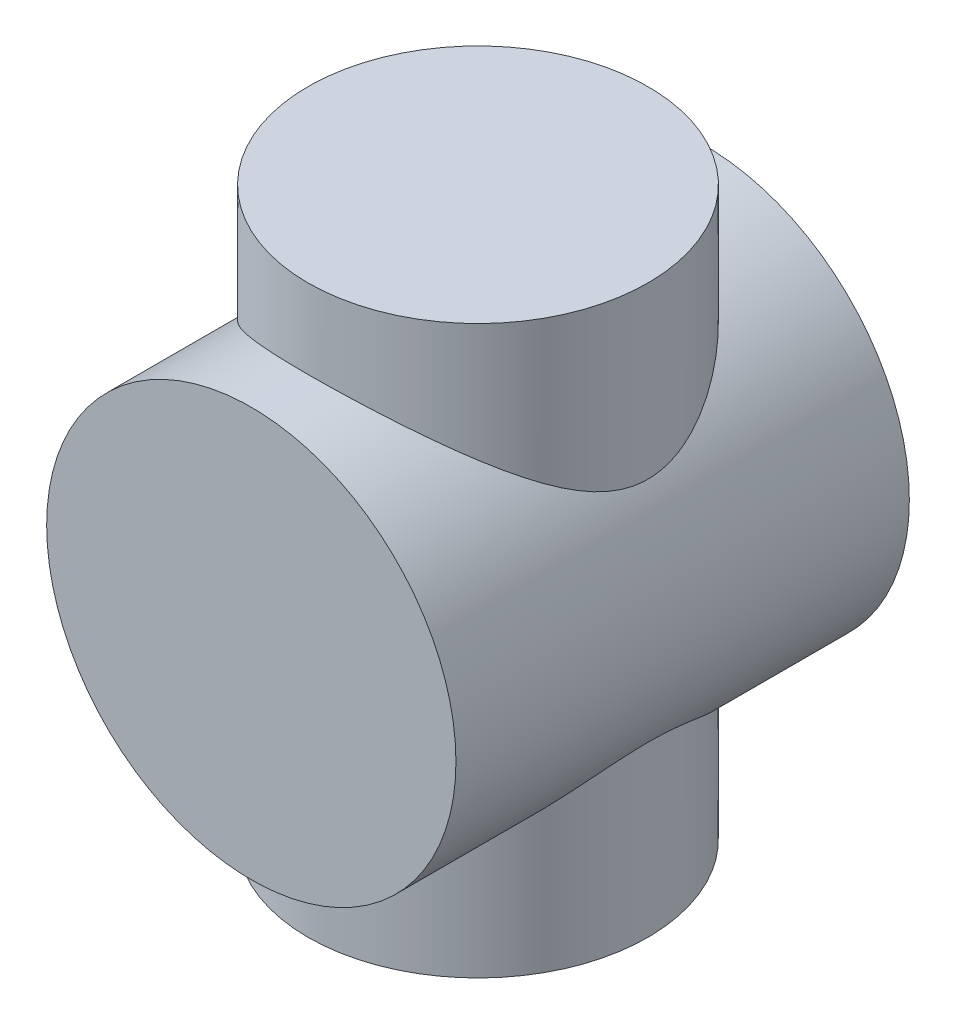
from build123d import *

# Parameters (mm, degrees)
SKETCH_1_W      = 15
SKETCH_1_H      = 50
SKETCH_2_R      = 18.053733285
EXTRUDE_1_DEPTH = 20


with BuildPart() as part:
    # Sketch 1 → Revolve 1 (revolve)
    with BuildSketch(Plane.XY, mode=Mode.PRIVATE) as revolve_1_sk:
        with Locations((-7.5, 23.185294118)):
            Rectangle(SKETCH_1_W, SKETCH_1_H)
    revolve(revolve_1_sk.sketch.rotate(Axis((0, 83.297058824, 0), (0, -1, 0)), 270), axis=Axis((0, 83.297058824, 0), (0, -1, 0)))

    # Sketch 2 → Extrude 1 (add, symmetric)
    with BuildSketch(Plane.XY):
        with Locations((0, 23.137235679)):
            Circle(SKETCH_2_R)
    extrude(amount=EXTRUDE_1_DEPTH, both=True)


solid = part.part
